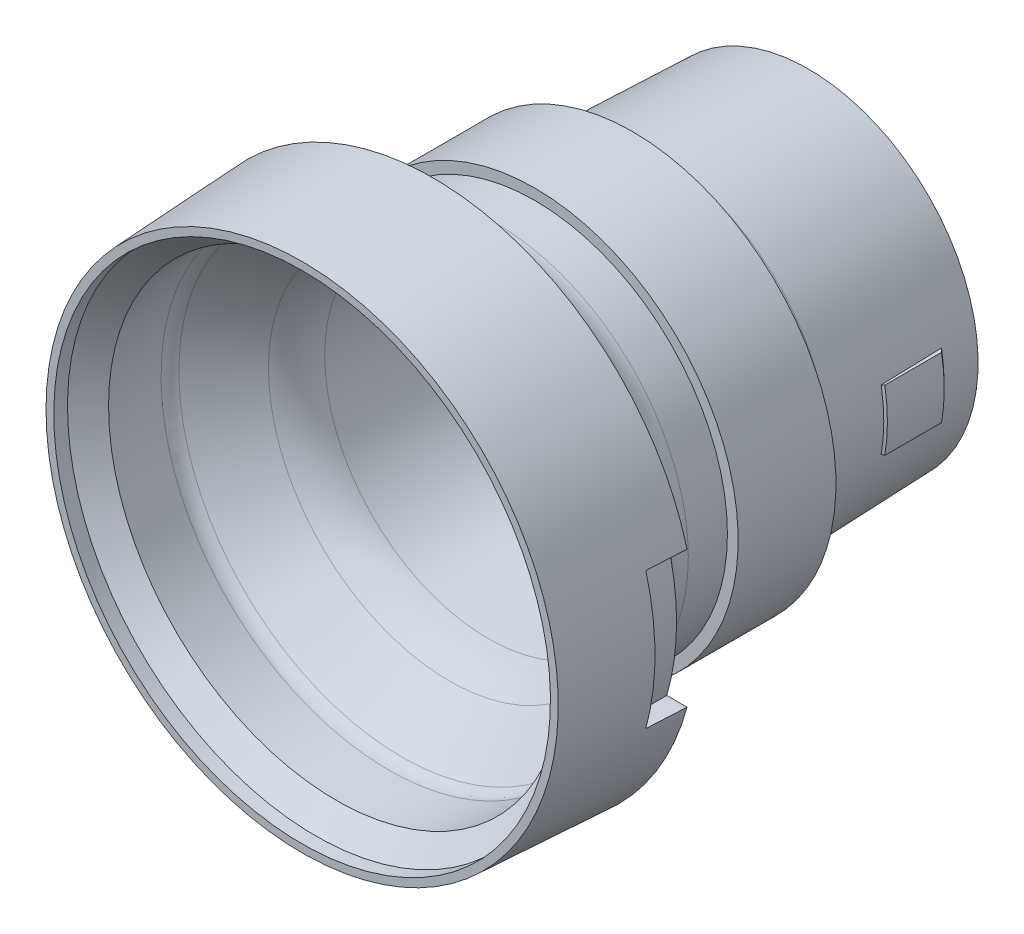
ISO-10303-21;
HEADER;
FILE_DESCRIPTION(('STEP AP214'),'2;1');
FILE_NAME('part.step','',(''),(''),'','','');
FILE_SCHEMA(('AUTOMOTIVE_DESIGN { 1 0 10303 214 1 1 1 1 }'));
ENDSEC;
DATA;
#1=APPLICATION_CONTEXT('core data for automotive mechanical design processes');
#2=APPLICATION_PROTOCOL_DEFINITION('international standard','automotive_design',2000,#1);
#3=PRODUCT_CONTEXT('',#1,'mechanical');
#4=PRODUCT('Part','Part','',(#3));
#5=PRODUCT_RELATED_PRODUCT_CATEGORY('part','',(#4));
#6=PRODUCT_DEFINITION_FORMATION('','',#4);
#7=PRODUCT_DEFINITION_CONTEXT('part definition',#1,'design');
#8=PRODUCT_DEFINITION('design','',#6,#7);
#9=PRODUCT_DEFINITION_SHAPE('','',#8);
#10=(LENGTH_UNIT() NAMED_UNIT(*) SI_UNIT(.MILLI.,.METRE.));
#11=(NAMED_UNIT(*) PLANE_ANGLE_UNIT() SI_UNIT($,.RADIAN.));
#12=(NAMED_UNIT(*) SI_UNIT($,.STERADIAN.) SOLID_ANGLE_UNIT());
#13=UNCERTAINTY_MEASURE_WITH_UNIT(LENGTH_MEASURE(1.E-05),#10,'distance_accuracy_value','');
#14=(GEOMETRIC_REPRESENTATION_CONTEXT(3) GLOBAL_UNCERTAINTY_ASSIGNED_CONTEXT((#13)) GLOBAL_UNIT_ASSIGNED_CONTEXT((#10,
#11,#12)) REPRESENTATION_CONTEXT('',''));
#15=CARTESIAN_POINT('',(0.,0.,0.));
#16=DIRECTION('',(0.,0.,1.));
#17=DIRECTION('',(1.,0.,0.));
#18=AXIS2_PLACEMENT_3D('',#15,#16,#17);
#19=CARTESIAN_POINT('',(0.,0.,14.4162507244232));
#20=DIRECTION('',(0.,0.,1.));
#21=DIRECTION('',(1.,0.,0.));
#22=AXIS2_PLACEMENT_3D('',#19,#20,#21);
#23=CONICAL_SURFACE('',#22,4.48499999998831,0.794963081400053);
#24=DIRECTION('',(-0.702992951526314,0.123956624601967,-0.700311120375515));
#25=VECTOR('',#24,1.);
#26=CARTESIAN_POINT('',(491419.068753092,-86650.4406557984,489554.382031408));
#27=LINE('',#26,#25);
#28=CARTESIAN_POINT('',(4.41686277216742,-0.778812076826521,14.4162507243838));
#29=VERTEX_POINT('',#28);
#30=CARTESIAN_POINT('',(4.30055572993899,-0.758304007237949,14.3003873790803));
#31=VERTEX_POINT('',#30);
#32=EDGE_CURVE('E230',#29,#31,#27,.T.);
#33=ORIENTED_EDGE('',*,*,#32,.T.);
#34=CARTESIAN_POINT('',(0.,0.,14.3003873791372));
#35=DIRECTION('',(0.,0.,1.));
#36=DIRECTION('',(-1.,0.,0.));
#37=AXIS2_PLACEMENT_3D('',#34,#35,#36);
#38=CIRCLE('',#37,4.36689873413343);
#39=CARTESIAN_POINT('',(4.30055572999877,0.758304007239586,14.3003873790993));
#40=VERTEX_POINT('',#39);
#41=EDGE_CURVE('E225',#31,#40,#38,.T.);
#42=ORIENTED_EDGE('',*,*,#41,.T.);
#43=DIRECTION('',(-0.702992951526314,-0.123956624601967,-0.700311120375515));
#44=VECTOR('',#43,1.);
#45=CARTESIAN_POINT('',(491419.068753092,86650.4406557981,489554.382031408));
#46=LINE('',#45,#44);
#47=CARTESIAN_POINT('',(4.41686277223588,0.778812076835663,14.4162507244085));
#48=VERTEX_POINT('',#47);
#49=EDGE_CURVE('E231',#40,#48,#46,.F.);
#50=ORIENTED_EDGE('',*,*,#49,.T.);
#51=CARTESIAN_POINT('',(0.,0.,14.4162507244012));
#52=DIRECTION('',(0.,0.,-1.));
#53=DIRECTION('',(0.,1.,0.));
#54=AXIS2_PLACEMENT_3D('',#51,#52,#53);
#55=CIRCLE('',#54,4.485);
#56=EDGE_CURVE('E211',#29,#48,#55,.F.);
#57=ORIENTED_EDGE('',*,*,#56,.F.);
#58=EDGE_LOOP('',(#33,#42,#50,#57));
#59=FACE_BOUND('',#58,.T.);
#60=ADVANCED_FACE('F14',(#59),#23,.T.);
#61=CARTESIAN_POINT('',(0.,0.,15.8685315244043));
#62=DIRECTION('',(0.,0.,-1.));
#63=DIRECTION('',(-1.,0.,0.));
#64=AXIS2_PLACEMENT_3D('',#61,#62,#63);
#65=CONICAL_SURFACE('',#64,4.48499999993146,1.09215181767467);
#66=CARTESIAN_POINT('',(0.,0.,15.9003873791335));
#67=DIRECTION('',(0.,0.,-1.));
#68=DIRECTION('',(1.,0.,0.));
#69=AXIS2_PLACEMENT_3D('',#66,#67,#68);
#70=CIRCLE('',#69,4.42360759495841);
#71=CARTESIAN_POINT('',(-4.35640305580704,-0.7681513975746,15.9003873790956));
#72=VERTEX_POINT('',#71);
#73=CARTESIAN_POINT('',(-4.35640305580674,0.768151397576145,15.9003873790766));
#74=VERTEX_POINT('',#73);
#75=EDGE_CURVE('E221',#72,#74,#70,.T.);
#76=ORIENTED_EDGE('',*,*,#75,.T.);
#77=DIRECTION('',(0.874135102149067,-0.154133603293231,0.460576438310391));
#78=VECTOR('',#77,1.);
#79=CARTESIAN_POINT('',(-491419.068753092,86650.4406557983,-258907.505606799));
#80=LINE('',#79,#78);
#81=CARTESIAN_POINT('',(-4.41686277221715,0.778812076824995,15.8685315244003));
#82=VERTEX_POINT('',#81);
#83=EDGE_CURVE('E218',#74,#82,#80,.F.);
#84=ORIENTED_EDGE('',*,*,#83,.T.);
#85=CARTESIAN_POINT('',(0.,0.,15.8685315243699));
#86=DIRECTION('',(0.,0.,1.));
#87=DIRECTION('',(0.,-1.,0.));
#88=AXIS2_PLACEMENT_3D('',#85,#86,#87);
#89=CIRCLE('',#88,4.485);
#90=CARTESIAN_POINT('',(-4.41686277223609,-0.778812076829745,15.8685315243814));
#91=VERTEX_POINT('',#90);
#92=EDGE_CURVE('E206',#91,#82,#89,.F.);
#93=ORIENTED_EDGE('',*,*,#92,.F.);
#94=DIRECTION('',(0.874135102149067,0.154133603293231,0.460576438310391));
#95=VECTOR('',#94,1.);
#96=CARTESIAN_POINT('',(-491419.068753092,-86650.4406557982,-258907.505606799));
#97=LINE('',#96,#95);
#98=EDGE_CURVE('E222',#91,#72,#97,.T.);
#99=ORIENTED_EDGE('',*,*,#98,.T.);
#100=EDGE_LOOP('',(#76,#84,#93,#99));
#101=FACE_BOUND('',#100,.T.);
#102=ADVANCED_FACE('F576',(#101),#65,.T.);
#103=CARTESIAN_POINT('',(0.,0.,67.4003873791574));
#104=DIRECTION('',(0.,0.,-1.));
#105=DIRECTION('',(0.,1.,0.));
#106=AXIS2_PLACEMENT_3D('',#103,#104,#105);
#107=CYLINDRICAL_SURFACE('',#106,4.485);
#108=CARTESIAN_POINT('',(0.,0.,15.8685315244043));
#109=DIRECTION('',(0.,0.,-1.));
#110=DIRECTION('',(1.,0.,0.));
#111=AXIS2_PLACEMENT_3D('',#108,#109,#110);
#112=CIRCLE('',#111,4.48499999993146);
#113=CARTESIAN_POINT('',(4.41686277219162,-0.778812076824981,15.8685315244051));
#114=VERTEX_POINT('',#113);
#115=CARTESIAN_POINT('',(4.41686277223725,0.778812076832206,15.8685315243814));
#116=VERTEX_POINT('',#115);
#117=EDGE_CURVE('E183',#114,#116,#112,.F.);
#118=ORIENTED_EDGE('',*,*,#117,.F.);
#119=DIRECTION('',(0.,0.,1.));
#120=VECTOR('',#119,1.);
#121=CARTESIAN_POINT('',(4.41686277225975,-0.778812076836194,15.9003873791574));
#122=LINE('',#121,#120);
#123=EDGE_CURVE('E197',#114,#29,#122,.F.);
#124=ORIENTED_EDGE('',*,*,#123,.T.);
#125=ORIENTED_EDGE('',*,*,#56,.T.);
#126=DIRECTION('',(0.,0.,1.));
#127=VECTOR('',#126,1.);
#128=CARTESIAN_POINT('',(4.41686277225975,0.778812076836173,15.9003873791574));
#129=LINE('',#128,#127);
#130=EDGE_CURVE('E182',#116,#48,#129,.F.);
#131=ORIENTED_EDGE('',*,*,#130,.F.);
#132=EDGE_LOOP('',(#118,#124,#125,#131));
#133=FACE_BOUND('',#132,.T.);
#134=ADVANCED_FACE('F594',(#133),#107,.T.);
#135=CARTESIAN_POINT('',(0.,0.,67.4003873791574));
#136=DIRECTION('',(0.,0.,1.));
#137=DIRECTION('',(0.,-1.,0.));
#138=AXIS2_PLACEMENT_3D('',#135,#136,#137);
#139=CYLINDRICAL_SURFACE('',#138,4.485);
#140=ORIENTED_EDGE('',*,*,#92,.T.);
#141=DIRECTION('',(0.,0.,1.));
#142=VECTOR('',#141,1.);
#143=CARTESIAN_POINT('',(-4.41686277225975,0.778812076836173,15.9003873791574));
#144=LINE('',#143,#142);
#145=CARTESIAN_POINT('',(-4.41686277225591,0.778812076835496,14.4162507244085));
#146=VERTEX_POINT('',#145);
#147=EDGE_CURVE('E189',#82,#146,#144,.F.);
#148=ORIENTED_EDGE('',*,*,#147,.T.);
#149=CARTESIAN_POINT('',(0.,0.,14.4162507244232));
#150=DIRECTION('',(0.,0.,1.));
#151=DIRECTION('',(-1.,0.,0.));
#152=AXIS2_PLACEMENT_3D('',#149,#150,#151);
#153=CIRCLE('',#152,4.48499999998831);
#154=CARTESIAN_POINT('',(-4.41686277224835,-0.778812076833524,14.4162507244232));
#155=VERTEX_POINT('',#154);
#156=EDGE_CURVE('E203',#155,#146,#153,.F.);
#157=ORIENTED_EDGE('',*,*,#156,.F.);
#158=DIRECTION('',(0.,0.,1.));
#159=VECTOR('',#158,1.);
#160=CARTESIAN_POINT('',(-4.41686277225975,-0.778812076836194,15.9003873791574));
#161=LINE('',#160,#159);
#162=EDGE_CURVE('E202',#91,#155,#161,.F.);
#163=ORIENTED_EDGE('',*,*,#162,.F.);
#164=EDGE_LOOP('',(#140,#148,#157,#163));
#165=FACE_BOUND('',#164,.T.);
#166=ADVANCED_FACE('F569',(#165),#139,.T.);
#167=CARTESIAN_POINT('',(0.,0.,14.4162507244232));
#168=DIRECTION('',(0.,0.,1.));
#169=DIRECTION('',(1.,0.,0.));
#170=AXIS2_PLACEMENT_3D('',#167,#168,#169);
#171=CONICAL_SURFACE('',#170,4.48499999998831,0.794963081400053);
#172=DIRECTION('',(0.702992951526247,0.123956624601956,-0.700311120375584));
#173=VECTOR('',#172,1.);
#174=CARTESIAN_POINT('',(-4.41686277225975,-0.778812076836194,14.4162507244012));
#175=LINE('',#174,#173);
#176=CARTESIAN_POINT('',(-4.30055573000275,-0.758304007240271,14.3003873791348));
#177=VERTEX_POINT('',#176);
#178=EDGE_CURVE('E175',#155,#177,#175,.T.);
#179=ORIENTED_EDGE('',*,*,#178,.F.);
#180=ORIENTED_EDGE('',*,*,#156,.T.);
#181=DIRECTION('',(0.702992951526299,-0.123956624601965,-0.70031112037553));
#182=VECTOR('',#181,1.);
#183=CARTESIAN_POINT('',(-4.41686277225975,0.778812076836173,14.4162507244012));
#184=LINE('',#183,#182);
#185=CARTESIAN_POINT('',(-4.30055573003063,0.758304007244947,14.3003873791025));
#186=VERTEX_POINT('',#185);
#187=EDGE_CURVE('E186',#146,#186,#184,.T.);
#188=ORIENTED_EDGE('',*,*,#187,.T.);
#189=CARTESIAN_POINT('',(0.,0.,14.3003873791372));
#190=DIRECTION('',(0.,0.,1.));
#191=DIRECTION('',(-1.,0.,0.));
#192=AXIS2_PLACEMENT_3D('',#189,#190,#191);
#193=CIRCLE('',#192,4.36689873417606);
#194=EDGE_CURVE('E172',#177,#186,#193,.F.);
#195=ORIENTED_EDGE('',*,*,#194,.F.);
#196=EDGE_LOOP('',(#179,#180,#188,#195));
#197=FACE_BOUND('',#196,.T.);
#198=ADVANCED_FACE('F571',(#197),#171,.T.);
#199=CARTESIAN_POINT('',(-4.35640305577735,0.768151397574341,15.9003873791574));
#200=DIRECTION('',(-0.173648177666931,-0.984807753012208,0.));
#201=DIRECTION('',(0.984807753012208,-0.173648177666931,0.));
#202=AXIS2_PLACEMENT_3D('',#199,#200,#201);
#203=PLANE('',#202);
#204=ORIENTED_EDGE('',*,*,#187,.F.);
#205=ORIENTED_EDGE('',*,*,#147,.F.);
#206=ORIENTED_EDGE('',*,*,#83,.F.);
#207=DIRECTION('',(0.0348826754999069,-0.0061507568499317,-0.99937248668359));
#208=VECTOR('',#207,1.);
#209=CARTESIAN_POINT('',(-17421.1861220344,3071.82514925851,499000.));
#210=LINE('',#209,#208);
#211=EDGE_CURVE('E171',#186,#74,#210,.F.);
#212=ORIENTED_EDGE('',*,*,#211,.F.);
#213=EDGE_LOOP('',(#204,#205,#206,#212));
#214=FACE_BOUND('',#213,.T.);
#215=ADVANCED_FACE('F578',(#214),#203,.F.);
#216=CARTESIAN_POINT('',(0.,0.,15.8685315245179));
#217=DIRECTION('',(0.,0.,-1.));
#218=DIRECTION('',(-1.,0.,0.));
#219=AXIS2_PLACEMENT_3D('',#216,#217,#218);
#220=CONICAL_SURFACE('',#219,4.48499999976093,1.09215181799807);
#221=CARTESIAN_POINT('',(0.,0.,15.9003873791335));
#222=DIRECTION('',(0.,0.,1.));
#223=DIRECTION('',(-1.,0.,0.));
#224=AXIS2_PLACEMENT_3D('',#221,#222,#223);
#225=CIRCLE('',#224,4.42360759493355);
#226=CARTESIAN_POINT('',(4.35640305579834,-0.768151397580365,15.9003873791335));
#227=VERTEX_POINT('',#226);
#228=CARTESIAN_POINT('',(4.35640305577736,0.768151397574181,15.9003873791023));
#229=VERTEX_POINT('',#228);
#230=EDGE_CURVE('E167',#227,#229,#225,.T.);
#231=ORIENTED_EDGE('',*,*,#230,.F.);
#232=DIRECTION('',(0.874135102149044,-0.154133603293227,-0.460576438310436));
#233=VECTOR('',#232,1.);
#234=CARTESIAN_POINT('',(4.35640305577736,-0.768151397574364,15.9003873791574));
#235=LINE('',#234,#233);
#236=EDGE_CURVE('E194',#227,#114,#235,.T.);
#237=ORIENTED_EDGE('',*,*,#236,.T.);
#238=ORIENTED_EDGE('',*,*,#117,.T.);
#239=DIRECTION('',(0.874135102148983,0.154133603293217,-0.460576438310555));
#240=VECTOR('',#239,1.);
#241=CARTESIAN_POINT('',(4.35640305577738,0.768151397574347,15.9003873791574));
#242=LINE('',#241,#240);
#243=EDGE_CURVE('E179',#229,#116,#242,.T.);
#244=ORIENTED_EDGE('',*,*,#243,.F.);
#245=EDGE_LOOP('',(#231,#237,#238,#244));
#246=FACE_BOUND('',#245,.T.);
#247=ADVANCED_FACE('F581',(#246),#220,.T.);
#248=CARTESIAN_POINT('',(4.35640305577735,0.768151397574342,15.9003873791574));
#249=DIRECTION('',(-0.173648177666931,0.984807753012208,0.));
#250=DIRECTION('',(-0.984807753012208,-0.173648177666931,0.));
#251=AXIS2_PLACEMENT_3D('',#248,#249,#250);
#252=PLANE('',#251);
#253=ORIENTED_EDGE('',*,*,#130,.T.);
#254=ORIENTED_EDGE('',*,*,#49,.F.);
#255=DIRECTION('',(-0.034882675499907,-0.00615075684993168,-0.99937248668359));
#256=VECTOR('',#255,1.);
#257=CARTESIAN_POINT('',(17421.1861220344,3071.82514925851,499000.));
#258=LINE('',#257,#256);
#259=EDGE_CURVE('E170',#229,#40,#258,.T.);
#260=ORIENTED_EDGE('',*,*,#259,.F.);
#261=ORIENTED_EDGE('',*,*,#243,.T.);
#262=EDGE_LOOP('',(#253,#254,#260,#261));
#263=FACE_BOUND('',#262,.T.);
#264=ADVANCED_FACE('F587',(#263),#252,.T.);
#265=CARTESIAN_POINT('',(4.35640305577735,-0.768151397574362,15.9003873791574));
#266=DIRECTION('',(0.173648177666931,0.984807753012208,0.));
#267=DIRECTION('',(-0.984807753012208,0.173648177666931,0.));
#268=AXIS2_PLACEMENT_3D('',#265,#266,#267);
#269=PLANE('',#268);
#270=ORIENTED_EDGE('',*,*,#32,.F.);
#271=ORIENTED_EDGE('',*,*,#123,.F.);
#272=ORIENTED_EDGE('',*,*,#236,.F.);
#273=DIRECTION('',(-0.034882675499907,0.00615075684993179,-0.99937248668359));
#274=VECTOR('',#273,1.);
#275=CARTESIAN_POINT('',(17421.1861220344,-3071.82514925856,499000.));
#276=LINE('',#275,#274);
#277=EDGE_CURVE('E178',#31,#227,#276,.F.);
#278=ORIENTED_EDGE('',*,*,#277,.F.);
#279=EDGE_LOOP('',(#270,#271,#272,#278));
#280=FACE_BOUND('',#279,.T.);
#281=ADVANCED_FACE('F606',(#280),#269,.F.);
#282=CARTESIAN_POINT('',(-4.35640305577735,-0.768151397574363,15.9003873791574));
#283=DIRECTION('',(0.173648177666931,-0.984807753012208,0.));
#284=DIRECTION('',(0.984807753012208,0.173648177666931,0.));
#285=AXIS2_PLACEMENT_3D('',#282,#283,#284);
#286=PLANE('',#285);
#287=ORIENTED_EDGE('',*,*,#162,.T.);
#288=ORIENTED_EDGE('',*,*,#178,.T.);
#289=DIRECTION('',(0.0348826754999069,0.0061507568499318,-0.99937248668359));
#290=VECTOR('',#289,1.);
#291=CARTESIAN_POINT('',(-17421.1861220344,-3071.82514925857,499000.));
#292=LINE('',#291,#290);
#293=EDGE_CURVE('E125',#72,#177,#292,.T.);
#294=ORIENTED_EDGE('',*,*,#293,.F.);
#295=ORIENTED_EDGE('',*,*,#98,.F.);
#296=EDGE_LOOP('',(#287,#288,#294,#295));
#297=FACE_BOUND('',#296,.T.);
#298=ADVANCED_FACE('F425',(#297),#286,.T.);
#299=CARTESIAN_POINT('',(0.,0.,17.3503873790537));
#300=DIRECTION('',(0.,0.,1.));
#301=DIRECTION('',(1.,0.,0.));
#302=AXIS2_PLACEMENT_3D('',#299,#300,#301);
#303=CONICAL_SURFACE('',#302,4.47499999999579,0.0354282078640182);
#304=CARTESIAN_POINT('',(-0.599437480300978,0.,18.9513900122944));
#305=DIRECTION('',(0.965925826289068,0.,0.258819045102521));
#306=DIRECTION('',(-0.258819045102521,0.,0.965925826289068));
#307=AXIS2_PLACEMENT_3D('',#304,#305,#306);
#308=ELLIPSE('',#307,17.5093158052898,4.49192408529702);
#309=CARTESIAN_POINT('',(0.620000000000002,-4.32624228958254,14.4003873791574));
#310=VERTEX_POINT('',#309);
#311=CARTESIAN_POINT('',(0.887949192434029,-4.24308510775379,13.4003873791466));
#312=VERTEX_POINT('',#311);
#313=EDGE_CURVE('E131',#310,#312,#308,.T.);
#314=ORIENTED_EDGE('',*,*,#313,.T.);
#315=CARTESIAN_POINT('',(0.,0.,13.4003873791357));
#316=DIRECTION('',(0.,0.,1.));
#317=DIRECTION('',(1.,0.,0.));
#318=AXIS2_PLACEMENT_3D('',#315,#316,#317);
#319=CIRCLE('',#318,4.33499999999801);
#320=CARTESIAN_POINT('',(-0.897949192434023,-4.24098010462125,13.4003873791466));
#321=VERTEX_POINT('',#320);
#322=EDGE_CURVE('E127',#312,#321,#319,.T.);
#323=ORIENTED_EDGE('',*,*,#322,.T.);
#324=CARTESIAN_POINT('',(0.599615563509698,0.,18.989375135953));
#325=DIRECTION('',(-0.965925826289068,0.,0.258819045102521));
#326=DIRECTION('',(0.258819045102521,0.,0.965925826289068));
#327=AXIS2_PLACEMENT_3D('',#324,#325,#326);
#328=ELLIPSE('',#327,17.5145175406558,4.49325856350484);
#329=CARTESIAN_POINT('',(-0.629999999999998,-4.32479737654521,14.4003873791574));
#330=VERTEX_POINT('',#329);
#331=EDGE_CURVE('E17',#321,#330,#328,.T.);
#332=ORIENTED_EDGE('',*,*,#331,.T.);
#333=CARTESIAN_POINT('',(-0.629999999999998,-4.32479737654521,14.4003873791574));
#334=CARTESIAN_POINT('',(-0.629999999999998,-4.33972113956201,14.8170539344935));
#335=CARTESIAN_POINT('',(-0.629999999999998,-4.35464334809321,15.2337205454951));
#336=CARTESIAN_POINT('',(-0.629999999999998,-4.38448465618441,16.0670538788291));
#337=CARTESIAN_POINT('',(-0.629999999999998,-4.39940375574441,16.4837206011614));
#338=CARTESIAN_POINT('',(-0.629999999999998,-4.41432130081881,16.9003873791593));
#339=B_SPLINE_CURVE_WITH_KNOTS('',3,(#333,#334,#335,#336,#337,#338),.UNSPECIFIED.,.F.,.F.,(4,2,
4),(0.,1.25080119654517,2.50160239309),.UNSPECIFIED.);
#340=CARTESIAN_POINT('',(-0.629999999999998,-4.41432130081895,16.900387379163));
#341=VERTEX_POINT('',#340);
#342=EDGE_CURVE('E164',#330,#341,#339,.T.);
#343=ORIENTED_EDGE('',*,*,#342,.T.);
#344=CARTESIAN_POINT('',(0.,0.,16.9003873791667));
#345=DIRECTION('',(0.,0.,1.));
#346=DIRECTION('',(1.,0.,0.));
#347=AXIS2_PLACEMENT_3D('',#344,#345,#346);
#348=CIRCLE('',#347,4.45905063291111);
#349=CARTESIAN_POINT('',(0.620000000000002,-4.41573692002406,16.900387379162));
#350=VERTEX_POINT('',#349);
#351=EDGE_CURVE('E159',#341,#350,#348,.T.);
#352=ORIENTED_EDGE('',*,*,#351,.T.);
#353=CARTESIAN_POINT('',(0.620000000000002,-4.41573692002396,16.9003873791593));
#354=CARTESIAN_POINT('',(0.620000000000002,-4.40082415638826,16.4837206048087));
#355=CARTESIAN_POINT('',(0.620000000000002,-4.38590988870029,16.0670538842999));
#356=CARTESIAN_POINT('',(0.620000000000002,-4.35607834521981,15.233720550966));
#357=CARTESIAN_POINT('',(0.620000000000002,-4.34116106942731,14.8170539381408));
#358=CARTESIAN_POINT('',(0.620000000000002,-4.32624228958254,14.4003873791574));
#359=B_SPLINE_CURVE_WITH_KNOTS('',3,(#353,#354,#355,#356,#357,#358),.UNSPECIFIED.,.F.,.F.,(4,2,
4),(0.,1.25080067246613,2.50160134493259),.UNSPECIFIED.);
#360=EDGE_CURVE('E148',#350,#310,#359,.T.);
#361=ORIENTED_EDGE('',*,*,#360,.T.);
#362=EDGE_LOOP('',(#314,#323,#332,#343,#352,#361));
#363=FACE_BOUND('',#362,.T.);
#364=ORIENTED_EDGE('',*,*,#41,.F.);
#365=ORIENTED_EDGE('',*,*,#277,.T.);
#366=ORIENTED_EDGE('',*,*,#230,.T.);
#367=ORIENTED_EDGE('',*,*,#259,.T.);
#368=EDGE_LOOP('',(#364,#365,#366,#367));
#369=FACE_BOUND('',#368,.T.);
#370=CARTESIAN_POINT('',(0.,0.,17.3503873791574));
#371=DIRECTION('',(0.,0.,-1.));
#372=DIRECTION('',(0.,1.,0.));
#373=AXIS2_PLACEMENT_3D('',#370,#371,#372);
#374=CIRCLE('',#373,4.475);
#375=CARTESIAN_POINT('',(0.,4.47499999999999,17.3503873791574));
#376=VERTEX_POINT('',#375);
#377=EDGE_CURVE('E135',#376,#376,#374,.F.);
#378=ORIENTED_EDGE('',*,*,#377,.F.);
#379=EDGE_LOOP('',(#378));
#380=FACE_BOUND('',#379,.T.);
#381=ORIENTED_EDGE('',*,*,#293,.T.);
#382=ORIENTED_EDGE('',*,*,#194,.T.);
#383=ORIENTED_EDGE('',*,*,#211,.T.);
#384=ORIENTED_EDGE('',*,*,#75,.F.);
#385=EDGE_LOOP('',(#381,#382,#383,#384));
#386=FACE_BOUND('',#385,.T.);
#387=ADVANCED_FACE('F128',(#363,#369,#380,#386),#303,.T.);
#388=CARTESIAN_POINT('',(-0.629999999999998,-3.69670123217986,14.4003873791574));
#389=DIRECTION('',(-0.965925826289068,0.,0.258819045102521));
#390=DIRECTION('',(0.258819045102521,0.,0.965925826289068));
#391=AXIS2_PLACEMENT_3D('',#388,#389,#390);
#392=PLANE('',#391);
#393=DIRECTION('',(0.,-1.,0.));
#394=VECTOR('',#393,1.);
#395=CARTESIAN_POINT('',(-0.897949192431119,4.33499999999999,13.4003873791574));
#396=LINE('',#395,#394);
#397=CARTESIAN_POINT('',(-0.89794919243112,-3.64090472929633,13.4003873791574));
#398=VERTEX_POINT('',#397);
#399=EDGE_CURVE('E119',#321,#398,#396,.F.);
#400=ORIENTED_EDGE('',*,*,#399,.T.);
#401=CARTESIAN_POINT('',(0.,0.,16.7515793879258));
#402=DIRECTION('',(-0.965925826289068,0.,0.258819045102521));
#403=DIRECTION('',(-0.258819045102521,0.,-0.965925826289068));
#404=AXIS2_PLACEMENT_3D('',#401,#402,#403);
#405=ELLIPSE('',#404,14.488887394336,3.75);
#406=CARTESIAN_POINT('',(-0.629999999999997,-3.69670123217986,14.4003873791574));
#407=VERTEX_POINT('',#406);
#408=EDGE_CURVE('E162',#398,#407,#405,.T.);
#409=ORIENTED_EDGE('',*,*,#408,.T.);
#410=DIRECTION('',(0.,1.,0.));
#411=VECTOR('',#410,1.);
#412=CARTESIAN_POINT('',(-0.629999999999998,-3.69670123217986,14.4003873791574));
#413=LINE('',#412,#411);
#414=EDGE_CURVE('E122',#407,#330,#413,.F.);
#415=ORIENTED_EDGE('',*,*,#414,.T.);
#416=ORIENTED_EDGE('',*,*,#331,.F.);
#417=EDGE_LOOP('',(#400,#409,#415,#416));
#418=FACE_BOUND('',#417,.T.);
#419=ADVANCED_FACE('F117',(#418),#392,.F.);
#420=CARTESIAN_POINT('',(-0.629999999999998,-3.69670123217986,16.9003873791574));
#421=DIRECTION('',(-1.,0.,0.));
#422=DIRECTION('',(0.,0.,1.));
#423=AXIS2_PLACEMENT_3D('',#420,#421,#422);
#424=PLANE('',#423);
#425=ORIENTED_EDGE('',*,*,#414,.F.);
#426=DIRECTION('',(0.,0.,-1.));
#427=VECTOR('',#426,1.);
#428=CARTESIAN_POINT('',(-0.629999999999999,-3.69670123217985,-43.5996126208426));
#429=LINE('',#428,#427);
#430=CARTESIAN_POINT('',(-0.629999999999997,-3.69670123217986,16.9003873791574));
#431=VERTEX_POINT('',#430);
#432=EDGE_CURVE('E160',#407,#431,#429,.F.);
#433=ORIENTED_EDGE('',*,*,#432,.T.);
#434=DIRECTION('',(0.,-1.,0.));
#435=VECTOR('',#434,1.);
#436=CARTESIAN_POINT('',(-0.629999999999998,0.,16.9003873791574));
#437=LINE('',#436,#435);
#438=EDGE_CURVE('E156',#431,#341,#437,.T.);
#439=ORIENTED_EDGE('',*,*,#438,.T.);
#440=ORIENTED_EDGE('',*,*,#342,.F.);
#441=EDGE_LOOP('',(#425,#433,#439,#440));
#442=FACE_BOUND('',#441,.T.);
#443=ADVANCED_FACE('F431',(#442),#424,.F.);
#444=CARTESIAN_POINT('',(0.,0.,16.9003873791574));
#445=DIRECTION('',(0.,0.,1.));
#446=DIRECTION('',(0.,-1.,0.));
#447=AXIS2_PLACEMENT_3D('',#444,#445,#446);
#448=PLANE('',#447);
#449=CARTESIAN_POINT('',(0.,0.,16.9003873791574));
#450=DIRECTION('',(0.,0.,-1.));
#451=DIRECTION('',(0.,1.,0.));
#452=AXIS2_PLACEMENT_3D('',#449,#450,#451);
#453=CIRCLE('',#452,3.75);
#454=CARTESIAN_POINT('',(0.620000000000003,-3.6983915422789,16.9003873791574));
#455=VERTEX_POINT('',#454);
#456=EDGE_CURVE('E152',#431,#455,#453,.F.);
#457=ORIENTED_EDGE('',*,*,#456,.T.);
#458=DIRECTION('',(0.,1.,0.));
#459=VECTOR('',#458,1.);
#460=CARTESIAN_POINT('',(0.620000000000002,-3.69839154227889,16.9003873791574));
#461=LINE('',#460,#459);
#462=EDGE_CURVE('E153',#455,#350,#461,.F.);
#463=ORIENTED_EDGE('',*,*,#462,.T.);
#464=ORIENTED_EDGE('',*,*,#351,.F.);
#465=ORIENTED_EDGE('',*,*,#438,.F.);
#466=EDGE_LOOP('',(#457,#463,#464,#465));
#467=FACE_BOUND('',#466,.T.);
#468=ADVANCED_FACE('F412',(#467),#448,.F.);
#469=CARTESIAN_POINT('',(0.620000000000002,-3.69839154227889,16.9003873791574));
#470=DIRECTION('',(1.,0.,0.));
#471=DIRECTION('',(0.,0.,-1.));
#472=AXIS2_PLACEMENT_3D('',#469,#470,#471);
#473=PLANE('',#472);
#474=DIRECTION('',(0.,1.,0.));
#475=VECTOR('',#474,1.);
#476=CARTESIAN_POINT('',(0.620000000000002,-3.69839154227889,14.4003873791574));
#477=LINE('',#476,#475);
#478=CARTESIAN_POINT('',(0.620000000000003,-3.6983915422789,14.4003873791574));
#479=VERTEX_POINT('',#478);
#480=EDGE_CURVE('E142',#479,#310,#477,.F.);
#481=ORIENTED_EDGE('',*,*,#480,.T.);
#482=ORIENTED_EDGE('',*,*,#360,.F.);
#483=ORIENTED_EDGE('',*,*,#462,.F.);
#484=DIRECTION('',(0.,0.,-1.));
#485=VECTOR('',#484,1.);
#486=CARTESIAN_POINT('',(0.620000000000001,-3.69839154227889,-43.5996126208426));
#487=LINE('',#486,#485);
#488=EDGE_CURVE('E149',#455,#479,#487,.T.);
#489=ORIENTED_EDGE('',*,*,#488,.T.);
#490=EDGE_LOOP('',(#481,#482,#483,#489));
#491=FACE_BOUND('',#490,.T.);
#492=ADVANCED_FACE('F407',(#491),#473,.F.);
#493=CARTESIAN_POINT('',(0.620000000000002,-3.69839154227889,14.4003873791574));
#494=DIRECTION('',(0.965925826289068,0.,0.258819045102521));
#495=DIRECTION('',(0.258819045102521,0.,-0.965925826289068));
#496=AXIS2_PLACEMENT_3D('',#493,#494,#495);
#497=PLANE('',#496);
#498=DIRECTION('',(0.,-1.,0.));
#499=VECTOR('',#498,1.);
#500=CARTESIAN_POINT('',(0.887949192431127,4.33499999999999,13.4003873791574));
#501=LINE('',#500,#499);
#502=CARTESIAN_POINT('',(0.887949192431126,-3.64335645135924,13.4003873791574));
#503=VERTEX_POINT('',#502);
#504=EDGE_CURVE('E136',#503,#312,#501,.T.);
#505=ORIENTED_EDGE('',*,*,#504,.T.);
#506=ORIENTED_EDGE('',*,*,#313,.F.);
#507=ORIENTED_EDGE('',*,*,#480,.F.);
#508=CARTESIAN_POINT('',(0.,0.,16.7142588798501));
#509=DIRECTION('',(0.965925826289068,0.,0.258819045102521));
#510=DIRECTION('',(0.258819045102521,0.,-0.965925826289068));
#511=AXIS2_PLACEMENT_3D('',#508,#509,#510);
#512=ELLIPSE('',#511,14.488887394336,3.75);
#513=EDGE_CURVE('E151',#479,#503,#512,.T.);
#514=ORIENTED_EDGE('',*,*,#513,.T.);
#515=EDGE_LOOP('',(#505,#506,#507,#514));
#516=FACE_BOUND('',#515,.T.);
#517=ADVANCED_FACE('F404',(#516),#497,.F.);
#518=CARTESIAN_POINT('',(0.,4.33499999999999,13.4003873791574));
#519=DIRECTION('',(0.,0.,1.));
#520=DIRECTION('',(0.,-1.,0.));
#521=AXIS2_PLACEMENT_3D('',#518,#519,#520);
#522=PLANE('',#521);
#523=ORIENTED_EDGE('',*,*,#322,.F.);
#524=ORIENTED_EDGE('',*,*,#504,.F.);
#525=CARTESIAN_POINT('',(0.,0.,13.4003873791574));
#526=DIRECTION('',(0.,0.,-1.));
#527=DIRECTION('',(0.,1.,0.));
#528=AXIS2_PLACEMENT_3D('',#525,#526,#527);
#529=CIRCLE('',#528,3.75);
#530=EDGE_CURVE('E139',#503,#398,#529,.F.);
#531=ORIENTED_EDGE('',*,*,#530,.T.);
#532=ORIENTED_EDGE('',*,*,#399,.F.);
#533=EDGE_LOOP('',(#523,#524,#531,#532));
#534=FACE_BOUND('',#533,.T.);
#535=ADVANCED_FACE('F138',(#534),#522,.F.);
#536=CARTESIAN_POINT('',(0.,0.,-43.5996126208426));
#537=DIRECTION('',(0.,0.,-1.));
#538=DIRECTION('',(0.,1.,0.));
#539=AXIS2_PLACEMENT_3D('',#536,#537,#538);
#540=CYLINDRICAL_SURFACE('',#539,4.475);
#541=CARTESIAN_POINT('',(0.,0.,17.9003873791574));
#542=DIRECTION('',(0.,0.,-1.));
#543=DIRECTION('',(0.,1.,0.));
#544=AXIS2_PLACEMENT_3D('',#541,#542,#543);
#545=CIRCLE('',#544,4.475);
#546=CARTESIAN_POINT('',(0.,4.47499999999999,17.9003873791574));
#547=VERTEX_POINT('',#546);
#548=EDGE_CURVE('E502',#547,#547,#545,.T.);
#549=ORIENTED_EDGE('',*,*,#548,.T.);
#550=EDGE_LOOP('',(#549));
#551=FACE_BOUND('',#550,.T.);
#552=ORIENTED_EDGE('',*,*,#377,.T.);
#553=EDGE_LOOP('',(#552));
#554=FACE_BOUND('',#553,.T.);
#555=ADVANCED_FACE('F397',(#551,#554),#540,.T.);
#556=CARTESIAN_POINT('',(0.,0.,-43.5996126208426));
#557=DIRECTION('',(0.,0.,-1.));
#558=DIRECTION('',(0.,1.,0.));
#559=AXIS2_PLACEMENT_3D('',#556,#557,#558);
#560=CYLINDRICAL_SURFACE('',#559,3.75);
#561=CARTESIAN_POINT('',(0.,0.,17.4829147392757));
#562=DIRECTION('',(0.,0.,1.));
#563=DIRECTION('',(-1.,0.,0.));
#564=AXIS2_PLACEMENT_3D('',#561,#562,#563);
#565=CIRCLE('',#564,3.7500000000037);
#566=CARTESIAN_POINT('',(-3.75000000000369,0.,17.4829147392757));
#567=VERTEX_POINT('',#566);
#568=EDGE_CURVE('E501',#567,#567,#565,.T.);
#569=ORIENTED_EDGE('',*,*,#568,.T.);
#570=EDGE_LOOP('',(#569));
#571=FACE_BOUND('',#570,.T.);
#572=ORIENTED_EDGE('',*,*,#408,.F.);
#573=ORIENTED_EDGE('',*,*,#530,.F.);
#574=ORIENTED_EDGE('',*,*,#513,.F.);
#575=ORIENTED_EDGE('',*,*,#488,.F.);
#576=ORIENTED_EDGE('',*,*,#456,.F.);
#577=ORIENTED_EDGE('',*,*,#432,.F.);
#578=EDGE_LOOP('',(#572,#573,#574,#575,#576,#577));
#579=FACE_BOUND('',#578,.T.);
#580=ADVANCED_FACE('F393',(#571,#579),#560,.F.);
#581=CARTESIAN_POINT('',(0.,5.19999999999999,17.9003873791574));
#582=DIRECTION('',(0.,0.,1.));
#583=DIRECTION('',(0.,-1.,0.));
#584=AXIS2_PLACEMENT_3D('',#581,#582,#583);
#585=PLANE('',#584);
#586=ORIENTED_EDGE('',*,*,#548,.F.);
#587=EDGE_LOOP('',(#586));
#588=FACE_BOUND('',#587,.T.);
#589=CARTESIAN_POINT('',(0.,0.,17.9003873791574));
#590=DIRECTION('',(0.,0.,-1.));
#591=DIRECTION('',(0.,1.,0.));
#592=AXIS2_PLACEMENT_3D('',#589,#590,#591);
#593=CIRCLE('',#592,5.2);
#594=CARTESIAN_POINT('',(0.,5.19999999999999,17.9003873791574));
#595=VERTEX_POINT('',#594);
#596=EDGE_CURVE('E498',#595,#595,#593,.F.);
#597=ORIENTED_EDGE('',*,*,#596,.F.);
#598=EDGE_LOOP('',(#597));
#599=FACE_BOUND('',#598,.T.);
#600=ADVANCED_FACE('F389',(#588,#599),#585,.F.);
#601=CARTESIAN_POINT('',(0.,0.,21.5889501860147));
#602=DIRECTION('',(0.,0.,1.));
#603=DIRECTION('',(1.,0.,0.));
#604=AXIS2_PLACEMENT_3D('',#601,#602,#603);
#605=CONICAL_SURFACE('',#604,4.18495953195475,0.105538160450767);
#606=ORIENTED_EDGE('',*,*,#568,.F.);
#607=EDGE_LOOP('',(#606));
#608=FACE_BOUND('',#607,.T.);
#609=CARTESIAN_POINT('',(0.,0.,21.5889501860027));
#610=DIRECTION('',(0.,0.,-1.));
#611=DIRECTION('',(1.,0.,0.));
#612=AXIS2_PLACEMENT_3D('',#609,#610,#611);
#613=CIRCLE('',#612,4.18495953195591);
#614=CARTESIAN_POINT('',(4.18495953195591,0.,21.5889501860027));
#615=VERTEX_POINT('',#614);
#616=EDGE_CURVE('E374',#615,#615,#613,.T.);
#617=ORIENTED_EDGE('',*,*,#616,.F.);
#618=EDGE_LOOP('',(#617));
#619=FACE_BOUND('',#618,.T.);
#620=ADVANCED_FACE('F385',(#608,#619),#605,.F.);
#621=CARTESIAN_POINT('',(0.,0.,-43.5996126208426));
#622=DIRECTION('',(0.,0.,-1.));
#623=DIRECTION('',(0.,1.,0.));
#624=AXIS2_PLACEMENT_3D('',#621,#622,#623);
#625=CYLINDRICAL_SURFACE('',#624,5.2);
#626=CARTESIAN_POINT('',(0.,0.,20.4003873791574));
#627=DIRECTION('',(0.,0.,-1.));
#628=DIRECTION('',(0.,1.,0.));
#629=AXIS2_PLACEMENT_3D('',#626,#627,#628);
#630=CIRCLE('',#629,5.2);
#631=CARTESIAN_POINT('',(0.,5.19999999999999,20.4003873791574));
#632=VERTEX_POINT('',#631);
#633=EDGE_CURVE('E369',#632,#632,#630,.T.);
#634=ORIENTED_EDGE('',*,*,#633,.T.);
#635=EDGE_LOOP('',(#634));
#636=FACE_BOUND('',#635,.T.);
#637=ORIENTED_EDGE('',*,*,#596,.T.);
#638=EDGE_LOOP('',(#637));
#639=FACE_BOUND('',#638,.T.);
#640=ADVANCED_FACE('F381',(#636,#639),#625,.T.);
#641=CARTESIAN_POINT('',(0.,0.,21.4003873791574));
#642=DIRECTION('',(0.,0.,-1.));
#643=DIRECTION('',(1.,0.,0.));
#644=AXIS2_PLACEMENT_3D('',#641,#642,#643);
#645=TOROIDAL_SURFACE('',#644,5.965,1.79);
#646=CARTESIAN_POINT('',(0.,0.,22.5864772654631));
#647=DIRECTION('',(0.,0.,1.));
#648=DIRECTION('',(-1.,0.,0.));
#649=AXIS2_PLACEMENT_3D('',#646,#647,#648);
#650=CIRCLE('',#649,4.62436925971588);
#651=CARTESIAN_POINT('',(-4.62436925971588,0.,22.5864772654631));
#652=VERTEX_POINT('',#651);
#653=EDGE_CURVE('E366',#652,#652,#650,.T.);
#654=ORIENTED_EDGE('',*,*,#653,.T.);
#655=EDGE_LOOP('',(#654));
#656=FACE_BOUND('',#655,.T.);
#657=ORIENTED_EDGE('',*,*,#616,.T.);
#658=EDGE_LOOP('',(#657));
#659=FACE_BOUND('',#658,.T.);
#660=ADVANCED_FACE('F376',(#656,#659),#645,.T.);
#661=CARTESIAN_POINT('',(0.,4.92499999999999,20.4003873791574));
#662=DIRECTION('',(0.,0.,-1.));
#663=DIRECTION('',(0.,1.,0.));
#664=AXIS2_PLACEMENT_3D('',#661,#662,#663);
#665=PLANE('',#664);
#666=CARTESIAN_POINT('',(0.,0.,20.4003873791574));
#667=DIRECTION('',(0.,0.,-1.));
#668=DIRECTION('',(0.,1.,0.));
#669=AXIS2_PLACEMENT_3D('',#666,#667,#668);
#670=CIRCLE('',#669,4.925);
#671=CARTESIAN_POINT('',(0.,4.92499999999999,20.4003873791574));
#672=VERTEX_POINT('',#671);
#673=EDGE_CURVE('E365',#672,#672,#670,.F.);
#674=ORIENTED_EDGE('',*,*,#673,.F.);
#675=EDGE_LOOP('',(#674));
#676=FACE_BOUND('',#675,.T.);
#677=ORIENTED_EDGE('',*,*,#633,.F.);
#678=EDGE_LOOP('',(#677));
#679=FACE_BOUND('',#678,.T.);
#680=ADVANCED_FACE('F380',(#676,#679),#665,.F.);
#681=CARTESIAN_POINT('',(0.,0.,23.8016664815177));
#682=DIRECTION('',(0.,0.,1.));
#683=DIRECTION('',(0.,-1.,0.));
#684=AXIS2_PLACEMENT_3D('',#681,#682,#683);
#685=CONICAL_SURFACE('',#684,5.69947786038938,0.724311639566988);
#686=CARTESIAN_POINT('',(0.,0.,23.8016664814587));
#687=DIRECTION('',(0.,0.,-1.));
#688=DIRECTION('',(1.,0.,0.));
#689=AXIS2_PLACEMENT_3D('',#686,#687,#688);
#690=CIRCLE('',#689,5.69947786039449);
#691=CARTESIAN_POINT('',(5.69947786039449,0.,23.8016664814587));
#692=VERTEX_POINT('',#691);
#693=EDGE_CURVE('E361',#692,#692,#690,.F.);
#694=ORIENTED_EDGE('',*,*,#693,.T.);
#695=EDGE_LOOP('',(#694));
#696=FACE_BOUND('',#695,.T.);
#697=ORIENTED_EDGE('',*,*,#653,.F.);
#698=EDGE_LOOP('',(#697));
#699=FACE_BOUND('',#698,.T.);
#700=ADVANCED_FACE('F709',(#696,#699),#685,.F.);
#701=CARTESIAN_POINT('',(0.,0.,-43.5996126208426));
#702=DIRECTION('',(0.,0.,-1.));
#703=DIRECTION('',(0.,1.,0.));
#704=AXIS2_PLACEMENT_3D('',#701,#702,#703);
#705=CYLINDRICAL_SURFACE('',#704,4.925);
#706=CARTESIAN_POINT('',(0.,0.,21.4003873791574));
#707=DIRECTION('',(0.,0.,-1.));
#708=DIRECTION('',(1.,0.,0.));
#709=AXIS2_PLACEMENT_3D('',#706,#707,#708);
#710=CIRCLE('',#709,4.92500000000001);
#711=CARTESIAN_POINT('',(4.92500000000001,0.,21.4003873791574));
#712=VERTEX_POINT('',#711);
#713=EDGE_CURVE('E364',#712,#712,#710,.T.);
#714=ORIENTED_EDGE('',*,*,#713,.T.);
#715=EDGE_LOOP('',(#714));
#716=FACE_BOUND('',#715,.T.);
#717=ORIENTED_EDGE('',*,*,#673,.T.);
#718=EDGE_LOOP('',(#717));
#719=FACE_BOUND('',#718,.T.);
#720=ADVANCED_FACE('F356',(#716,#719),#705,.T.);
#721=CARTESIAN_POINT('',(0.,0.,24.1329765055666));
#722=DIRECTION('',(0.,0.,-1.));
#723=DIRECTION('',(1.,0.,0.));
#724=AXIS2_PLACEMENT_3D('',#721,#722,#723);
#725=TOROIDAL_SURFACE('',#724,5.325,0.5);
#726=ORIENTED_EDGE('',*,*,#693,.F.);
#727=EDGE_LOOP('',(#726));
#728=FACE_BOUND('',#727,.T.);
#729=CARTESIAN_POINT('',(0.,0.,24.1329765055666));
#730=DIRECTION('',(0.,0.,-1.));
#731=DIRECTION('',(0.,1.,0.));
#732=AXIS2_PLACEMENT_3D('',#729,#730,#731);
#733=CIRCLE('',#732,5.825);
#734=CARTESIAN_POINT('',(0.,5.82499999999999,24.1329765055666));
#735=VERTEX_POINT('',#734);
#736=EDGE_CURVE('E339',#735,#735,#733,.F.);
#737=ORIENTED_EDGE('',*,*,#736,.T.);
#738=EDGE_LOOP('',(#737));
#739=FACE_BOUND('',#738,.T.);
#740=ADVANCED_FACE('F351',(#728,#739),#725,.F.);
#741=CARTESIAN_POINT('',(0.,0.,21.4003873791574));
#742=DIRECTION('',(0.,0.,-1.));
#743=DIRECTION('',(1.,0.,0.));
#744=AXIS2_PLACEMENT_3D('',#741,#742,#743);
#745=TOROIDAL_SURFACE('',#744,5.965,1.03999999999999);
#746=ORIENTED_EDGE('',*,*,#713,.F.);
#747=EDGE_LOOP('',(#746));
#748=FACE_BOUND('',#747,.T.);
#749=CARTESIAN_POINT('',(0.,0.,22.0106069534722));
#750=DIRECTION('',(0.,0.,1.));
#751=DIRECTION('',(-1.,0.,0.));
#752=AXIS2_PLACEMENT_3D('',#749,#750,#751);
#753=CIRCLE('',#752,5.12284082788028);
#754=CARTESIAN_POINT('',(-5.12284082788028,0.,22.0106069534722));
#755=VERTEX_POINT('',#754);
#756=EDGE_CURVE('E335',#755,#755,#753,.T.);
#757=ORIENTED_EDGE('',*,*,#756,.F.);
#758=EDGE_LOOP('',(#757));
#759=FACE_BOUND('',#758,.T.);
#760=ADVANCED_FACE('F346',(#748,#759),#745,.F.);
#761=CARTESIAN_POINT('',(0.,0.,-43.5996126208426));
#762=DIRECTION('',(0.,0.,-1.));
#763=DIRECTION('',(0.,1.,0.));
#764=AXIS2_PLACEMENT_3D('',#761,#762,#763);
#765=CYLINDRICAL_SURFACE('',#764,5.825);
#766=ORIENTED_EDGE('',*,*,#736,.F.);
#767=EDGE_LOOP('',(#766));
#768=FACE_BOUND('',#767,.T.);
#769=CARTESIAN_POINT('',(0.,0.,25.4753019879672));
#770=DIRECTION('',(0.,0.,1.));
#771=DIRECTION('',(-1.,0.,0.));
#772=AXIS2_PLACEMENT_3D('',#769,#770,#771);
#773=CIRCLE('',#772,5.82500000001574);
#774=CARTESIAN_POINT('',(-5.82500000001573,0.,25.4753019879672));
#775=VERTEX_POINT('',#774);
#776=EDGE_CURVE('E338',#775,#775,#773,.T.);
#777=ORIENTED_EDGE('',*,*,#776,.T.);
#778=EDGE_LOOP('',(#777));
#779=FACE_BOUND('',#778,.T.);
#780=ADVANCED_FACE('F350',(#768,#779),#765,.F.);
#781=CARTESIAN_POINT('',(0.,0.,22.7937621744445));
#782=DIRECTION('',(0.,0.,1.));
#783=DIRECTION('',(1.,0.,0.));
#784=AXIS2_PLACEMENT_3D('',#781,#782,#783);
#785=CONICAL_SURFACE('',#784,5.69030676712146,0.627038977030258);
#786=CARTESIAN_POINT('',(0.,0.,22.7937621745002));
#787=DIRECTION('',(0.,0.,1.));
#788=DIRECTION('',(-1.,0.,0.));
#789=AXIS2_PLACEMENT_3D('',#786,#787,#788);
#790=CIRCLE('',#789,5.69030676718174);
#791=CARTESIAN_POINT('',(-5.69030676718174,0.,22.7937621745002));
#792=VERTEX_POINT('',#791);
#793=EDGE_CURVE('E300',#792,#792,#790,.F.);
#794=ORIENTED_EDGE('',*,*,#793,.T.);
#795=EDGE_LOOP('',(#794));
#796=FACE_BOUND('',#795,.T.);
#797=ORIENTED_EDGE('',*,*,#756,.T.);
#798=EDGE_LOOP('',(#797));
#799=FACE_BOUND('',#798,.T.);
#800=ADVANCED_FACE('F746',(#796,#799),#785,.T.);
#801=CARTESIAN_POINT('',(0.,0.,26.0003873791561));
#802=DIRECTION('',(0.,0.,1.));
#803=DIRECTION('',(0.,-1.,0.));
#804=AXIS2_PLACEMENT_3D('',#801,#802,#803);
#805=CONICAL_SURFACE('',#804,6.35000000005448,0.78531684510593);
#806=CARTESIAN_POINT('',(0.,0.,26.0003873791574));
#807=DIRECTION('',(0.,0.,-1.));
#808=DIRECTION('',(0.,1.,0.));
#809=AXIS2_PLACEMENT_3D('',#806,#807,#808);
#810=CIRCLE('',#809,6.35);
#811=CARTESIAN_POINT('',(0.,6.34999999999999,26.0003873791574));
#812=VERTEX_POINT('',#811);
#813=EDGE_CURVE('E332',#812,#812,#810,.F.);
#814=ORIENTED_EDGE('',*,*,#813,.T.);
#815=EDGE_LOOP('',(#814));
#816=FACE_BOUND('',#815,.T.);
#817=ORIENTED_EDGE('',*,*,#776,.F.);
#818=EDGE_LOOP('',(#817));
#819=FACE_BOUND('',#818,.T.);
#820=ADVANCED_FACE('F755',(#816,#819),#805,.F.);
#821=CARTESIAN_POINT('',(0.,0.,24.0003873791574));
#822=DIRECTION('',(0.,0.,-1.));
#823=DIRECTION('',(0.,1.,0.));
#824=AXIS2_PLACEMENT_3D('',#821,#822,#823);
#825=CYLINDRICAL_SURFACE('',#824,6.225);
#826=CARTESIAN_POINT('',(0.,0.,24.0003873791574));
#827=DIRECTION('',(0.,0.,-1.));
#828=DIRECTION('',(0.,1.,0.));
#829=AXIS2_PLACEMENT_3D('',#826,#827,#828);
#830=CIRCLE('',#829,6.225);
#831=CARTESIAN_POINT('',(5.97395388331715,1.74999999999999,24.0003873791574));
#832=VERTEX_POINT('',#831);
#833=CARTESIAN_POINT('',(5.97395388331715,-1.75000000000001,24.0003873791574));
#834=VERTEX_POINT('',#833);
#835=EDGE_CURVE('E295',#832,#834,#830,.T.);
#836=ORIENTED_EDGE('',*,*,#835,.T.);
#837=DIRECTION('',(0.,0.,1.));
#838=VECTOR('',#837,1.);
#839=CARTESIAN_POINT('',(5.97395388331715,-1.75000000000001,24.0003873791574));
#840=LINE('',#839,#838);
#841=CARTESIAN_POINT('',(5.97395388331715,-1.75000000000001,23.0003873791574));
#842=VERTEX_POINT('',#841);
#843=EDGE_CURVE('E299',#842,#834,#840,.T.);
#844=ORIENTED_EDGE('',*,*,#843,.F.);
#845=CARTESIAN_POINT('',(0.,0.,23.0003873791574));
#846=DIRECTION('',(0.,0.,-1.));
#847=DIRECTION('',(0.,1.,0.));
#848=AXIS2_PLACEMENT_3D('',#845,#846,#847);
#849=CIRCLE('',#848,6.225);
#850=CARTESIAN_POINT('',(5.97395388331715,1.74999999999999,23.0003873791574));
#851=VERTEX_POINT('',#850);
#852=EDGE_CURVE('E281',#842,#851,#849,.F.);
#853=ORIENTED_EDGE('',*,*,#852,.T.);
#854=DIRECTION('',(0.,0.,-1.));
#855=VECTOR('',#854,1.);
#856=CARTESIAN_POINT('',(5.97395388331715,1.74999999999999,24.0003873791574));
#857=LINE('',#856,#855);
#858=EDGE_CURVE('E291',#832,#851,#857,.T.);
#859=ORIENTED_EDGE('',*,*,#858,.F.);
#860=EDGE_LOOP('',(#836,#844,#853,#859));
#861=FACE_BOUND('',#860,.T.);
#862=ADVANCED_FACE('F314',(#861),#825,.T.);
#863=CARTESIAN_POINT('',(0.,0.,22.5003873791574));
#864=DIRECTION('',(0.,0.,1.));
#865=DIRECTION('',(-1.,0.,0.));
#866=AXIS2_PLACEMENT_3D('',#863,#864,#865);
#867=TOROIDAL_SURFACE('',#866,6.0951909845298,0.5);
#868=CARTESIAN_POINT('',(0.,0.,23.0003873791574));
#869=DIRECTION('',(0.,0.,-1.));
#870=DIRECTION('',(-1.,0.,0.));
#871=AXIS2_PLACEMENT_3D('',#868,#869,#870);
#872=CIRCLE('',#871,6.0951909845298);
#873=CARTESIAN_POINT('',(-6.0951909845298,0.,23.0003873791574));
#874=VERTEX_POINT('',#873);
#875=EDGE_CURVE('E280',#874,#874,#872,.T.);
#876=ORIENTED_EDGE('',*,*,#875,.T.);
#877=EDGE_LOOP('',(#876));
#878=FACE_BOUND('',#877,.T.);
#879=ORIENTED_EDGE('',*,*,#793,.F.);
#880=EDGE_LOOP('',(#879));
#881=FACE_BOUND('',#880,.T.);
#882=ADVANCED_FACE('F308',(#878,#881),#867,.F.);
#883=CARTESIAN_POINT('',(0.,0.,24.0003873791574));
#884=DIRECTION('',(0.,0.,-1.));
#885=DIRECTION('',(0.,1.,0.));
#886=AXIS2_PLACEMENT_3D('',#883,#884,#885);
#887=CYLINDRICAL_SURFACE('',#886,6.225);
#888=CARTESIAN_POINT('',(0.,0.,24.0003873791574));
#889=DIRECTION('',(0.,0.,-1.));
#890=DIRECTION('',(0.,1.,0.));
#891=AXIS2_PLACEMENT_3D('',#888,#889,#890);
#892=CIRCLE('',#891,6.225);
#893=CARTESIAN_POINT('',(-5.97395388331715,1.74999999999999,24.0003873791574));
#894=VERTEX_POINT('',#893);
#895=CARTESIAN_POINT('',(-5.97395388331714,-1.75000000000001,24.0003873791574));
#896=VERTEX_POINT('',#895);
#897=EDGE_CURVE('E488',#894,#896,#892,.F.);
#898=ORIENTED_EDGE('',*,*,#897,.F.);
#899=DIRECTION('',(0.,0.,-1.));
#900=VECTOR('',#899,1.);
#901=CARTESIAN_POINT('',(-5.97395388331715,1.74999999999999,24.0003873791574));
#902=LINE('',#901,#900);
#903=CARTESIAN_POINT('',(-5.97395388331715,1.74999999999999,23.0003873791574));
#904=VERTEX_POINT('',#903);
#905=EDGE_CURVE('E301',#904,#894,#902,.F.);
#906=ORIENTED_EDGE('',*,*,#905,.F.);
#907=CARTESIAN_POINT('',(0.,0.,23.0003873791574));
#908=DIRECTION('',(0.,0.,-1.));
#909=DIRECTION('',(0.,1.,0.));
#910=AXIS2_PLACEMENT_3D('',#907,#908,#909);
#911=CIRCLE('',#910,6.225);
#912=CARTESIAN_POINT('',(-5.97395388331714,-1.75000000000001,23.0003873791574));
#913=VERTEX_POINT('',#912);
#914=EDGE_CURVE('E287',#904,#913,#911,.F.);
#915=ORIENTED_EDGE('',*,*,#914,.T.);
#916=DIRECTION('',(0.,0.,1.));
#917=VECTOR('',#916,1.);
#918=CARTESIAN_POINT('',(-5.97395388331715,-1.75000000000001,24.0003873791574));
#919=LINE('',#918,#917);
#920=EDGE_CURVE('E296',#896,#913,#919,.F.);
#921=ORIENTED_EDGE('',*,*,#920,.F.);
#922=EDGE_LOOP('',(#898,#906,#915,#921));
#923=FACE_BOUND('',#922,.T.);
#924=ADVANCED_FACE('F313',(#923),#887,.T.);
#925=CARTESIAN_POINT('',(-5.97395388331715,-1.75000000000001,24.0003873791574));
#926=DIRECTION('',(0.,1.,0.));
#927=DIRECTION('',(0.,0.,1.));
#928=AXIS2_PLACEMENT_3D('',#925,#926,#927);
#929=PLANE('',#928);
#930=ORIENTED_EDGE('',*,*,#920,.T.);
#931=DIRECTION('',(1.,0.,0.));
#932=VECTOR('',#931,1.);
#933=CARTESIAN_POINT('',(0.,-1.75000000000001,23.0003873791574));
#934=LINE('',#933,#932);
#935=CARTESIAN_POINT('',(-6.49331386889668,-1.75000000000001,23.0003873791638));
#936=VERTEX_POINT('',#935);
#937=EDGE_CURVE('E285',#913,#936,#934,.F.);
#938=ORIENTED_EDGE('',*,*,#937,.T.);
#939=CARTESIAN_POINT('',(-6.439020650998,-1.75000000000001,24.0003873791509));
#940=CARTESIAN_POINT('',(-6.44807210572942,-1.75000000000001,23.833720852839));
#941=CARTESIAN_POINT('',(-6.45712226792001,-1.75000000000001,23.6670542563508));
#942=CARTESIAN_POINT('',(-6.47522000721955,-1.75000000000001,23.3337209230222));
#943=CARTESIAN_POINT('',(-6.48426758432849,-1.75000000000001,23.1670541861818));
#944=CARTESIAN_POINT('',(-6.49331386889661,-1.75000000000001,23.0003873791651));
#945=B_SPLINE_CURVE_WITH_KNOTS('',3,(#939,#940,#941,#942,#943,#944),.UNSPECIFIED.,.F.,.F.,(4,2,
4),(0.,0.500736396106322,1.0014727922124),.UNSPECIFIED.);
#946=CARTESIAN_POINT('',(-6.43902065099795,-1.75000000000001,24.000387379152));
#947=VERTEX_POINT('',#946);
#948=EDGE_CURVE('E466',#947,#936,#945,.T.);
#949=ORIENTED_EDGE('',*,*,#948,.F.);
#950=DIRECTION('',(1.,0.,0.));
#951=VECTOR('',#950,1.);
#952=CARTESIAN_POINT('',(0.,-1.75000000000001,24.0003873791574));
#953=LINE('',#952,#951);
#954=EDGE_CURVE('E487',#896,#947,#953,.F.);
#955=ORIENTED_EDGE('',*,*,#954,.F.);
#956=EDGE_LOOP('',(#930,#938,#949,#955));
#957=FACE_BOUND('',#956,.T.);
#958=ADVANCED_FACE('F479',(#957),#929,.T.);
#959=CARTESIAN_POINT('',(6.49331386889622,-1.75000000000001,24.0003873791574));
#960=DIRECTION('',(0.,1.,0.));
#961=DIRECTION('',(0.,0.,1.));
#962=AXIS2_PLACEMENT_3D('',#959,#960,#961);
#963=PLANE('',#962);
#964=ORIENTED_EDGE('',*,*,#843,.T.);
#965=DIRECTION('',(1.,0.,0.));
#966=VECTOR('',#965,1.);
#967=CARTESIAN_POINT('',(0.,-1.75000000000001,24.0003873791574));
#968=LINE('',#967,#966);
#969=CARTESIAN_POINT('',(6.43902065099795,-1.75000000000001,24.000387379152));
#970=VERTEX_POINT('',#969);
#971=EDGE_CURVE('E292',#834,#970,#968,.T.);
#972=ORIENTED_EDGE('',*,*,#971,.T.);
#973=CARTESIAN_POINT('',(6.49331386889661,-1.75000000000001,23.0003873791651));
#974=CARTESIAN_POINT('',(6.48426758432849,-1.75000000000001,23.1670541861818));
#975=CARTESIAN_POINT('',(6.47522000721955,-1.75000000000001,23.3337209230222));
#976=CARTESIAN_POINT('',(6.45712226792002,-1.75000000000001,23.6670542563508));
#977=CARTESIAN_POINT('',(6.44807210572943,-1.75000000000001,23.833720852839));
#978=CARTESIAN_POINT('',(6.43902065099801,-1.75000000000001,24.0003873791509));
#979=B_SPLINE_CURVE_WITH_KNOTS('',3,(#973,#974,#975,#976,#977,#978),.UNSPECIFIED.,.F.,.F.,(4,2,
4),(0.,0.500736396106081,1.0014727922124),.UNSPECIFIED.);
#980=CARTESIAN_POINT('',(6.49331386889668,-1.75000000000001,23.0003873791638));
#981=VERTEX_POINT('',#980);
#982=EDGE_CURVE('E453',#981,#970,#979,.T.);
#983=ORIENTED_EDGE('',*,*,#982,.F.);
#984=DIRECTION('',(1.,0.,0.));
#985=VECTOR('',#984,1.);
#986=CARTESIAN_POINT('',(0.,-1.75000000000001,23.0003873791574));
#987=LINE('',#986,#985);
#988=EDGE_CURVE('E282',#981,#842,#987,.F.);
#989=ORIENTED_EDGE('',*,*,#988,.T.);
#990=EDGE_LOOP('',(#964,#972,#983,#989));
#991=FACE_BOUND('',#990,.T.);
#992=ADVANCED_FACE('F474',(#991),#963,.T.);
#993=CARTESIAN_POINT('',(0.,0.,-43.5996126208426));
#994=DIRECTION('',(0.,0.,-1.));
#995=DIRECTION('',(0.,1.,0.));
#996=AXIS2_PLACEMENT_3D('',#993,#994,#995);
#997=CYLINDRICAL_SURFACE('',#996,6.35);
#998=ORIENTED_EDGE('',*,*,#813,.F.);
#999=EDGE_LOOP('',(#998));
#1000=FACE_BOUND('',#999,.T.);
#1001=CARTESIAN_POINT('',(0.,0.,26.3503873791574));
#1002=DIRECTION('',(0.,0.,-1.));
#1003=DIRECTION('',(0.,1.,0.));
#1004=AXIS2_PLACEMENT_3D('',#1001,#1002,#1003);
#1005=CIRCLE('',#1004,6.35);
#1006=CARTESIAN_POINT('',(0.,6.34999999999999,26.3503873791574));
#1007=VERTEX_POINT('',#1006);
#1008=EDGE_CURVE('E462',#1007,#1007,#1005,.F.);
#1009=ORIENTED_EDGE('',*,*,#1008,.T.);
#1010=EDGE_LOOP('',(#1009));
#1011=FACE_BOUND('',#1010,.T.);
#1012=ADVANCED_FACE('F478',(#1000,#1011),#997,.F.);
#1013=CARTESIAN_POINT('',(0.,0.,24.0003873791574));
#1014=DIRECTION('',(0.,0.,1.));
#1015=DIRECTION('',(0.,-1.,0.));
#1016=AXIS2_PLACEMENT_3D('',#1013,#1014,#1015);
#1017=PLANE('',#1016);
#1018=ORIENTED_EDGE('',*,*,#835,.F.);
#1019=DIRECTION('',(1.,0.,0.));
#1020=VECTOR('',#1019,1.);
#1021=CARTESIAN_POINT('',(6.49331386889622,1.74999999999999,24.0003873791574));
#1022=LINE('',#1021,#1020);
#1023=CARTESIAN_POINT('',(6.43902065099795,1.74999999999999,24.000387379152));
#1024=VERTEX_POINT('',#1023);
#1025=EDGE_CURVE('E288',#1024,#832,#1022,.F.);
#1026=ORIENTED_EDGE('',*,*,#1025,.F.);
#1027=CARTESIAN_POINT('',(0.,0.,24.0003873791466));
#1028=DIRECTION('',(0.,0.,-1.));
#1029=DIRECTION('',(-1.,0.,0.));
#1030=AXIS2_PLACEMENT_3D('',#1027,#1028,#1029);
#1031=CIRCLE('',#1030,6.67259222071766);
#1032=EDGE_CURVE('E457',#970,#1024,#1031,.F.);
#1033=ORIENTED_EDGE('',*,*,#1032,.F.);
#1034=ORIENTED_EDGE('',*,*,#971,.F.);
#1035=EDGE_LOOP('',(#1018,#1026,#1033,#1034));
#1036=FACE_BOUND('',#1035,.T.);
#1037=ADVANCED_FACE('F806',(#1036),#1017,.F.);
#1038=CARTESIAN_POINT('',(6.49331386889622,1.74999999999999,24.0003873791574));
#1039=DIRECTION('',(0.,-1.,0.));
#1040=DIRECTION('',(0.,0.,-1.));
#1041=AXIS2_PLACEMENT_3D('',#1038,#1039,#1040);
#1042=PLANE('',#1041);
#1043=ORIENTED_EDGE('',*,*,#858,.T.);
#1044=DIRECTION('',(1.,0.,0.));
#1045=VECTOR('',#1044,1.);
#1046=CARTESIAN_POINT('',(0.,1.74999999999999,23.0003873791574));
#1047=LINE('',#1046,#1045);
#1048=CARTESIAN_POINT('',(6.49331386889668,1.74999999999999,23.0003873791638));
#1049=VERTEX_POINT('',#1048);
#1050=EDGE_CURVE('E273',#851,#1049,#1047,.T.);
#1051=ORIENTED_EDGE('',*,*,#1050,.T.);
#1052=CARTESIAN_POINT('',(6.43902065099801,1.74999999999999,24.0003873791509));
#1053=CARTESIAN_POINT('',(6.44807210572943,1.74999999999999,23.833720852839));
#1054=CARTESIAN_POINT('',(6.45712226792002,1.74999999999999,23.6670542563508));
#1055=CARTESIAN_POINT('',(6.47522000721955,1.74999999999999,23.3337209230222));
#1056=CARTESIAN_POINT('',(6.48426758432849,1.74999999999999,23.1670541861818));
#1057=CARTESIAN_POINT('',(6.49331386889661,1.74999999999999,23.0003873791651));
#1058=B_SPLINE_CURVE_WITH_KNOTS('',3,(#1052,#1053,#1054,#1055,#1056,#1057),.UNSPECIFIED.,.F.,
.F.,(4,2,4),(0.,0.500736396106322,1.0014727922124),.UNSPECIFIED.);
#1059=EDGE_CURVE('E1100',#1024,#1049,#1058,.T.);
#1060=ORIENTED_EDGE('',*,*,#1059,.F.);
#1061=ORIENTED_EDGE('',*,*,#1025,.T.);
#1062=EDGE_LOOP('',(#1043,#1051,#1060,#1061));
#1063=FACE_BOUND('',#1062,.T.);
#1064=ADVANCED_FACE('F262',(#1063),#1042,.T.);
#1065=CARTESIAN_POINT('',(0.,5.8400251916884,23.0003873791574));
#1066=DIRECTION('',(0.,0.,1.));
#1067=DIRECTION('',(0.,-1.,0.));
#1068=AXIS2_PLACEMENT_3D('',#1065,#1066,#1067);
#1069=PLANE('',#1068);
#1070=ORIENTED_EDGE('',*,*,#875,.F.);
#1071=EDGE_LOOP('',(#1070));
#1072=FACE_BOUND('',#1071,.T.);
#1073=CARTESIAN_POINT('',(0.,0.,23.0003873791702));
#1074=DIRECTION('',(0.,0.,-1.));
#1075=DIRECTION('',(-1.,0.,0.));
#1076=AXIS2_PLACEMENT_3D('',#1073,#1074,#1075);
#1077=CIRCLE('',#1076,6.72500000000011);
#1078=CARTESIAN_POINT('',(-6.49331386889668,1.74999999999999,23.0003873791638));
#1079=VERTEX_POINT('',#1078);
#1080=EDGE_CURVE('E247',#1049,#1079,#1077,.F.);
#1081=ORIENTED_EDGE('',*,*,#1080,.F.);
#1082=ORIENTED_EDGE('',*,*,#1050,.F.);
#1083=ORIENTED_EDGE('',*,*,#852,.F.);
#1084=ORIENTED_EDGE('',*,*,#988,.F.);
#1085=CARTESIAN_POINT('',(0.,0.,23.0003873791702));
#1086=DIRECTION('',(0.,0.,-1.));
#1087=DIRECTION('',(-1.,0.,0.));
#1088=AXIS2_PLACEMENT_3D('',#1085,#1086,#1087);
#1089=CIRCLE('',#1088,6.72500000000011);
#1090=EDGE_CURVE('E460',#936,#981,#1089,.F.);
#1091=ORIENTED_EDGE('',*,*,#1090,.F.);
#1092=ORIENTED_EDGE('',*,*,#937,.F.);
#1093=ORIENTED_EDGE('',*,*,#914,.F.);
#1094=DIRECTION('',(1.,0.,0.));
#1095=VECTOR('',#1094,1.);
#1096=CARTESIAN_POINT('',(-5.97395388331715,1.74999999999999,23.0003873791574));
#1097=LINE('',#1096,#1095);
#1098=EDGE_CURVE('E303',#1079,#904,#1097,.T.);
#1099=ORIENTED_EDGE('',*,*,#1098,.F.);
#1100=EDGE_LOOP('',(#1081,#1082,#1083,#1084,#1091,#1092,#1093,#1099));
#1101=FACE_BOUND('',#1100,.T.);
#1102=ADVANCED_FACE('F258',(#1072,#1101),#1069,.F.);
#1103=CARTESIAN_POINT('',(-5.97395388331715,1.74999999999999,24.0003873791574));
#1104=DIRECTION('',(0.,-1.,0.));
#1105=DIRECTION('',(0.,0.,-1.));
#1106=AXIS2_PLACEMENT_3D('',#1103,#1104,#1105);
#1107=PLANE('',#1106);
#1108=ORIENTED_EDGE('',*,*,#905,.T.);
#1109=DIRECTION('',(1.,0.,0.));
#1110=VECTOR('',#1109,1.);
#1111=CARTESIAN_POINT('',(0.,1.74999999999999,24.0003873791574));
#1112=LINE('',#1111,#1110);
#1113=CARTESIAN_POINT('',(-6.43902065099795,1.74999999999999,24.000387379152));
#1114=VERTEX_POINT('',#1113);
#1115=EDGE_CURVE('E32',#1114,#894,#1112,.T.);
#1116=ORIENTED_EDGE('',*,*,#1115,.F.);
#1117=CARTESIAN_POINT('',(-6.49331386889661,1.74999999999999,23.0003873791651));
#1118=CARTESIAN_POINT('',(-6.48426758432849,1.74999999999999,23.1670541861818));
#1119=CARTESIAN_POINT('',(-6.47522000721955,1.74999999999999,23.3337209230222));
#1120=CARTESIAN_POINT('',(-6.45712226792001,1.74999999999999,23.6670542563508));
#1121=CARTESIAN_POINT('',(-6.44807210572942,1.74999999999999,23.833720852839));
#1122=CARTESIAN_POINT('',(-6.439020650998,1.74999999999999,24.0003873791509));
#1123=B_SPLINE_CURVE_WITH_KNOTS('',3,(#1117,#1118,#1119,#1120,#1121,#1122),.UNSPECIFIED.,.F.,
.F.,(4,2,4),(0.,0.500736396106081,1.0014727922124),.UNSPECIFIED.);
#1124=EDGE_CURVE('E239',#1079,#1114,#1123,.T.);
#1125=ORIENTED_EDGE('',*,*,#1124,.F.);
#1126=ORIENTED_EDGE('',*,*,#1098,.T.);
#1127=EDGE_LOOP('',(#1108,#1116,#1125,#1126));
#1128=FACE_BOUND('',#1127,.T.);
#1129=ADVANCED_FACE('F252',(#1128),#1107,.T.);
#1130=CARTESIAN_POINT('',(0.,0.,24.0003873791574));
#1131=DIRECTION('',(0.,0.,-1.));
#1132=DIRECTION('',(0.,1.,0.));
#1133=AXIS2_PLACEMENT_3D('',#1130,#1131,#1132);
#1134=PLANE('',#1133);
#1135=ORIENTED_EDGE('',*,*,#897,.T.);
#1136=ORIENTED_EDGE('',*,*,#954,.T.);
#1137=CARTESIAN_POINT('',(0.,0.,24.0003873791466));
#1138=DIRECTION('',(0.,0.,-1.));
#1139=DIRECTION('',(-1.,0.,0.));
#1140=AXIS2_PLACEMENT_3D('',#1137,#1138,#1139);
#1141=CIRCLE('',#1140,6.67259222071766);
#1142=EDGE_CURVE('E23',#1114,#947,#1141,.F.);
#1143=ORIENTED_EDGE('',*,*,#1142,.F.);
#1144=ORIENTED_EDGE('',*,*,#1115,.T.);
#1145=EDGE_LOOP('',(#1135,#1136,#1143,#1144));
#1146=FACE_BOUND('',#1145,.T.);
#1147=ADVANCED_FACE('F257',(#1146),#1134,.T.);
#1148=CARTESIAN_POINT('',(0.,6.5494339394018,26.3503873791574));
#1149=DIRECTION('',(0.,0.,-1.));
#1150=DIRECTION('',(0.,1.,0.));
#1151=AXIS2_PLACEMENT_3D('',#1148,#1149,#1150);
#1152=PLANE('',#1151);
#1153=ORIENTED_EDGE('',*,*,#1008,.F.);
#1154=EDGE_LOOP('',(#1153));
#1155=FACE_BOUND('',#1154,.T.);
#1156=CARTESIAN_POINT('',(0.,0.,26.3503873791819));
#1157=DIRECTION('',(0.,0.,-1.));
#1158=DIRECTION('',(-1.,0.,0.));
#1159=AXIS2_PLACEMENT_3D('',#1156,#1157,#1158);
#1160=CIRCLE('',#1159,6.54943393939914);
#1161=CARTESIAN_POINT('',(-6.54943393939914,0.,26.3503873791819));
#1162=VERTEX_POINT('',#1161);
#1163=EDGE_CURVE('E9',#1162,#1162,#1160,.T.);
#1164=ORIENTED_EDGE('',*,*,#1163,.F.);
#1165=EDGE_LOOP('',(#1164));
#1166=FACE_BOUND('',#1165,.T.);
#1167=ADVANCED_FACE('F442',(#1155,#1166),#1152,.F.);
#1168=CARTESIAN_POINT('',(0.,0.,23.0003873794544));
#1169=DIRECTION('',(0.,0.,-1.));
#1170=DIRECTION('',(-1.,0.,0.));
#1171=AXIS2_PLACEMENT_3D('',#1168,#1169,#1170);
#1172=CONICAL_SURFACE('',#1171,6.72499999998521,0.0523598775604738);
#1173=ORIENTED_EDGE('',*,*,#982,.T.);
#1174=ORIENTED_EDGE('',*,*,#1032,.T.);
#1175=ORIENTED_EDGE('',*,*,#1059,.T.);
#1176=ORIENTED_EDGE('',*,*,#1080,.T.);
#1177=ORIENTED_EDGE('',*,*,#1124,.T.);
#1178=ORIENTED_EDGE('',*,*,#1142,.T.);
#1179=ORIENTED_EDGE('',*,*,#948,.T.);
#1180=ORIENTED_EDGE('',*,*,#1090,.T.);
#1181=EDGE_LOOP('',(#1173,#1174,#1175,#1176,#1177,#1178,#1179,#1180));
#1182=FACE_BOUND('',#1181,.T.);
#1183=ORIENTED_EDGE('',*,*,#1163,.T.);
#1184=EDGE_LOOP('',(#1183));
#1185=FACE_BOUND('',#1184,.T.);
#1186=ADVANCED_FACE('F249',(#1182,#1185),#1172,.T.);
#1187=CLOSED_SHELL('',(#60,#102,#134,#166,#198,#215,#247,#264,#281,#298,#387,#419,#443,#468,
#492,#517,#535,#555,#580,#600,#620,#640,#660,#680,#700,#720,#740,#760,#780,#800,#820,#862,#882,
#924,#958,#992,#1012,#1037,#1064,#1102,#1129,#1147,#1167,#1186));
#1188=MANIFOLD_SOLID_BREP('B1',#1187);
#1189=ADVANCED_BREP_SHAPE_REPRESENTATION('',(#18,#1188),#14);
#1190=SHAPE_DEFINITION_REPRESENTATION(#9,#1189);
ENDSEC;
END-ISO-10303-21;
